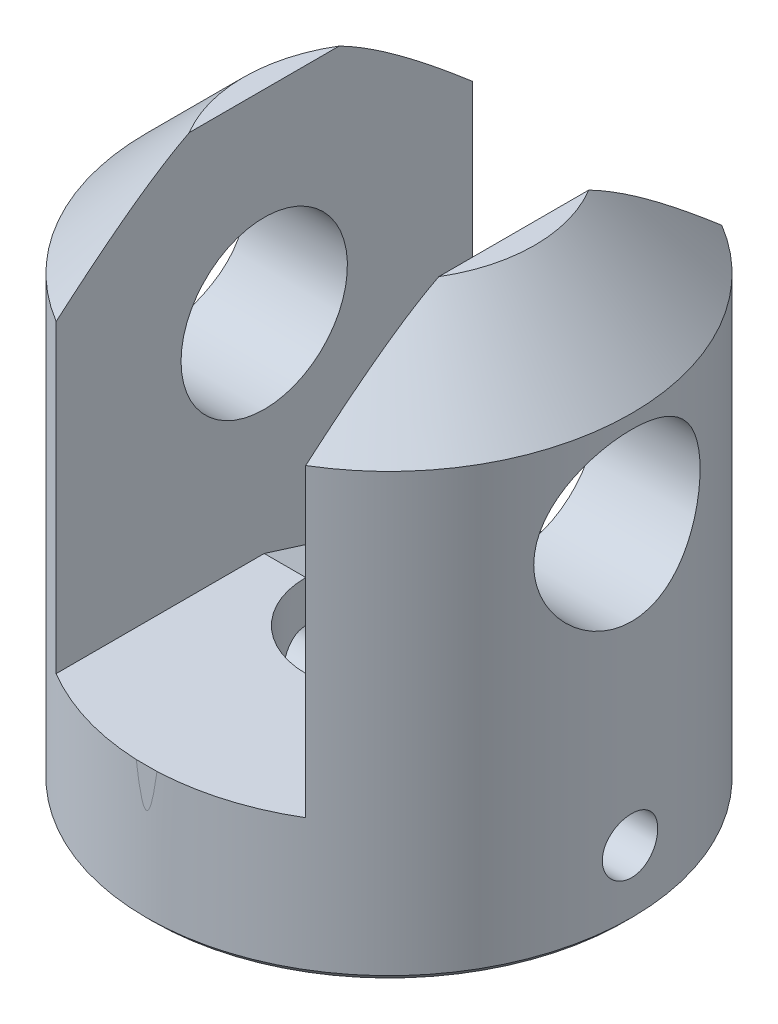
from build123d import *

# Parameters (mm, degrees)
ESQUISSE1_R                  = 17.5
EXTRUSION1_DEPTH             = 39
CHANFREIN1_SIZE              = 7
ENL_V_MAT_EXTRU_4_DEPTH      = 47.18982572
ENL_V_MAT_EXTRU_4_DEPTH_BACK = 47.18982572
ESQUISSE6_R                  = 2
ENL_V_MAT_EXTRU_1_DEPTH      = 9
ENL_V_MAT_EXTRU_2_DEPTH      = 47.189825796
ENL_V_MAT_EXTRU_2_DEPTH_BACK = 47.189825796
ESQUISSE4_R                  = 6
ESQUISSE5_R                  = 6
ENL_V_MAT_EXTRU_3_DEPTH      = 47.189825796
CHANFREIN2_SIZE              = 0.5


with BuildPart() as part:
    # Esquisse1 → Extrusion1 (new body)
    with BuildSketch(Plane(origin=(0, 0, 0), x_dir=(1, 0, 0), z_dir=(0, 1, 0))):
        with Locations(Location((0, 0, 0), (0, 0, 270))):
            Circle(ESQUISSE1_R)
    extrude(amount=EXTRUSION1_DEPTH)

    # Chanfrein1
    chanfrein1_edges = [part.edges().sort_by_distance(p)[0] for p in [
        (0, 39, -17.5),
    ]]
    chamfer(chanfrein1_edges, length=CHANFREIN1_SIZE)

    # Esquisse6 → Enl_v. mat.-Extru.4 (cut, two sides: drawn at the far end of the back side and taken through both)
    with BuildSketch(Plane(origin=(0, 0, 0), x_dir=(0, 0, -1), z_dir=(1, 0, 0)).offset(-ENL_V_MAT_EXTRU_4_DEPTH_BACK)):
        with Locations((0, 5)):
            Circle(ESQUISSE6_R)
    extrude(amount=ENL_V_MAT_EXTRU_4_DEPTH + ENL_V_MAT_EXTRU_4_DEPTH_BACK, mode=Mode.SUBTRACT)

    # Esquisse3 → Enl_v. mat.-Extru.1 (cut, symmetric)
    with BuildSketch(Plane(origin=(0, 0, 0), x_dir=(0, 0, -1), z_dir=(1, 0, 0))):
        Polygon((-17.483969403, 10), (0, 10), (17.5, 4.5), (17.5, 32), (10.5, 39), (-10.5, 39), (-17.5, 32), (-17.5, 7.205201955), align=None)
    extrude(amount=ENL_V_MAT_EXTRU_1_DEPTH, both=True, mode=Mode.SUBTRACT)

    # Esquisse4 → Enl_v. mat.-Extru.2 (cut, two sides: drawn at the far end of the back side and taken through both)
    with BuildSketch(Plane(origin=(0, 0, 0), x_dir=(0, 0, -1), z_dir=(1, 0, 0)).offset(-ENL_V_MAT_EXTRU_2_DEPTH_BACK)):
        with Locations((0, 25)):
            Circle(ESQUISSE4_R)
    extrude(amount=ENL_V_MAT_EXTRU_2_DEPTH + ENL_V_MAT_EXTRU_2_DEPTH_BACK, mode=Mode.SUBTRACT)

    # Esquisse5 → Enl_v. mat.-Extru.3 (cut, through all)
    with BuildSketch(Plane.XZ):
        with Locations(Location((0, 0, 0), (0, 0, 270))):
            Circle(ESQUISSE5_R)
    extrude(amount=-ENL_V_MAT_EXTRU_3_DEPTH, mode=Mode.SUBTRACT)

    # Chanfrein2
    chanfrein2_edges = [part.edges().sort_by_distance(p)[0] for p in [
        (0, 0, -17.5),
    ]]
    chamfer(chanfrein2_edges, length=CHANFREIN2_SIZE)


solid = part.part
